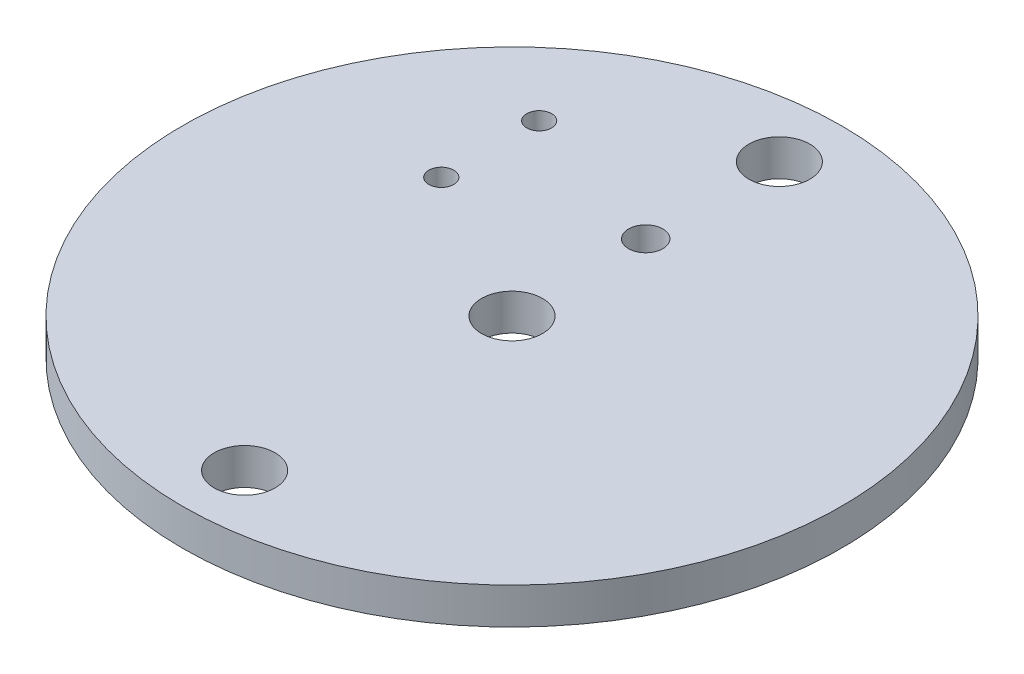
from build123d import *

# Parameters (mm, degrees)
SKETCH1_R              = 26.924
BOSS_EXTRUDE1_DEPTH    = 2.9718
F_10_CLEARANCE_HOLE1_D = 4.9784
SKETCH5_R              = 1.4
SKETCH5_R_2            = 1.016
CUT_EXTRUDE1_DEPTH     = 39.192082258


with BuildPart() as part:
    # Sketch1 → Boss-Extrude1 (new body)
    with BuildSketch(Plane(origin=(0, 0, 0), x_dir=(1, 0, 0), z_dir=(0, 1, 0))):
        with Locations(Location((0, 0, 0), (0, 0, 270))):
            Circle(SKETCH1_R)
    extrude(amount=BOSS_EXTRUDE1_DEPTH)

    # 10 Clearance Hole1 (through all)
    with Locations(Plane(origin=(0, 2.9718, 0), x_dir=(1, 0, 0), z_dir=(0, 1, 0))):
        with Locations((0, 0), (0, -21.844), (0, 21.844)):
            Hole(F_10_CLEARANCE_HOLE1_D / 2)

    # Sketch5 → Cut-Extrude1 (cut, through all)
    with BuildSketch(Plane(origin=(0, 2.9718, 0), x_dir=(1, 0, 0), z_dir=(0, 1, 0))):
        with Locations(Location((0, 10.922, 0), (0, 0, 270))):
            Circle(SKETCH5_R)
        with Locations(Location((-12.7, 14.922, 0), (0, 0, 270))):
            Circle(SKETCH5_R_2)
        with Locations(Location((-12.7, 6.922, 0), (0, 0, 270))):
            Circle(SKETCH5_R_2)
    extrude(amount=-CUT_EXTRUDE1_DEPTH, mode=Mode.SUBTRACT)


solid = part.part
